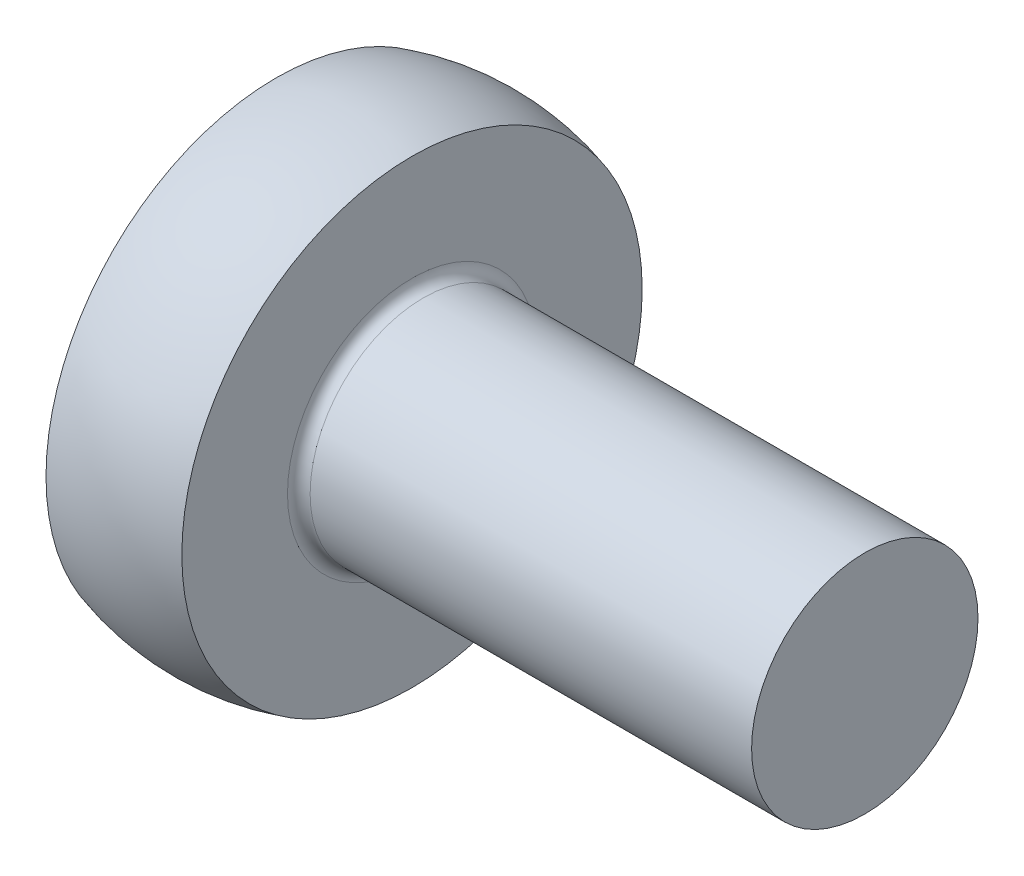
from build123d import *

# Parameters (mm, degrees)
FILLET1_R = 0.1


with BuildPart() as part:
    # Sketch1 → Base-Revolve (revolve)
    with BuildSketch(Plane.XY, mode=Mode.PRIVATE) as base_revolve_sk:
        with BuildLine():
            Line((0, 2.033322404), (0, 0))
            Line((0, 0), (5.2, 0))
            Line((5.2, 0), (5.2, 1))
            Line((5.2, 1), (1.2, 1))
            Line((1.2, 1), (1.2, 2.033322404))
            ThreePointArc((1.2, 2.033322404), (0.6, 2.12), (0, 2.033322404))
        make_face()
    revolve(base_revolve_sk.sketch.rotate(Axis((-2.318253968, 0, 0), (1, 0, 0)), 90), axis=Axis((-2.318253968, 0, 0), (1, 0, 0)))

    # Fillet1
    fillet1_edges = [part.edges().sort_by_distance(p)[0] for p in [
        (1.2, 0, -1),
    ]]
    fillet(fillet1_edges, radius=FILLET1_R)


solid = part.part
